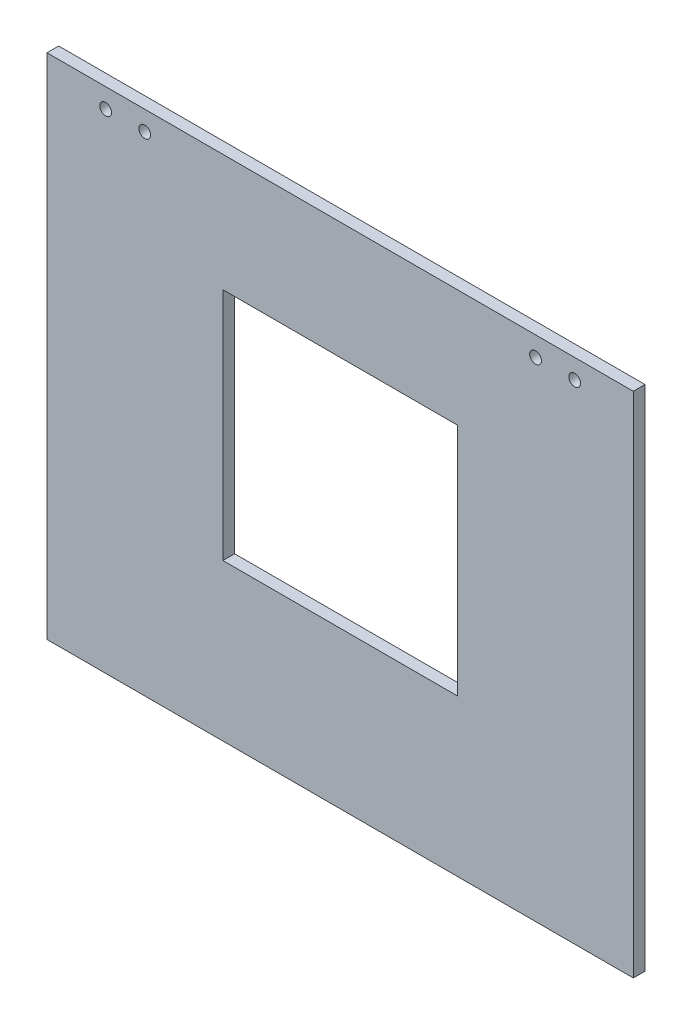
ISO-10303-21;
HEADER;
FILE_DESCRIPTION(('STEP AP214'),'2;1');
FILE_NAME('part.step','',(''),(''),'','','');
FILE_SCHEMA(('AUTOMOTIVE_DESIGN { 1 0 10303 214 1 1 1 1 }'));
ENDSEC;
DATA;
#1=APPLICATION_CONTEXT('core data for automotive mechanical design processes');
#2=APPLICATION_PROTOCOL_DEFINITION('international standard','automotive_design',2000,#1);
#3=PRODUCT_CONTEXT('',#1,'mechanical');
#4=PRODUCT('Part','Part','',(#3));
#5=PRODUCT_RELATED_PRODUCT_CATEGORY('part','',(#4));
#6=PRODUCT_DEFINITION_FORMATION('','',#4);
#7=PRODUCT_DEFINITION_CONTEXT('part definition',#1,'design');
#8=PRODUCT_DEFINITION('design','',#6,#7);
#9=PRODUCT_DEFINITION_SHAPE('','',#8);
#10=(LENGTH_UNIT() NAMED_UNIT(*) SI_UNIT(.MILLI.,.METRE.));
#11=(NAMED_UNIT(*) PLANE_ANGLE_UNIT() SI_UNIT($,.RADIAN.));
#12=(NAMED_UNIT(*) SI_UNIT($,.STERADIAN.) SOLID_ANGLE_UNIT());
#13=UNCERTAINTY_MEASURE_WITH_UNIT(LENGTH_MEASURE(1.E-05),#10,'distance_accuracy_value','');
#14=(GEOMETRIC_REPRESENTATION_CONTEXT(3) GLOBAL_UNCERTAINTY_ASSIGNED_CONTEXT((#13)) GLOBAL_UNIT_ASSIGNED_CONTEXT((#10,
#11,#12)) REPRESENTATION_CONTEXT('',''));
#15=CARTESIAN_POINT('',(0.,0.,0.));
#16=DIRECTION('',(0.,0.,1.));
#17=DIRECTION('',(1.,0.,0.));
#18=AXIS2_PLACEMENT_3D('',#15,#16,#17);
#19=CARTESIAN_POINT('',(0.,130.,3.));
#20=DIRECTION('',(0.,0.,-1.));
#21=DIRECTION('',(-1.,0.,0.));
#22=AXIS2_PLACEMENT_3D('',#19,#20,#21);
#23=PLANE('',#22);
#24=CARTESIAN_POINT('',(25.,125.,3.));
#25=DIRECTION('',(0.,0.,1.));
#26=DIRECTION('',(1.,0.,0.));
#27=AXIS2_PLACEMENT_3D('',#24,#25,#26);
#28=CIRCLE('',#27,1.5);
#29=CARTESIAN_POINT('',(26.5,125.,3.));
#30=VERTEX_POINT('',#29);
#31=EDGE_CURVE('E241',#30,#30,#28,.T.);
#32=ORIENTED_EDGE('',*,*,#31,.F.);
#33=EDGE_LOOP('',(#32));
#34=FACE_BOUND('',#33,.T.);
#35=CARTESIAN_POINT('',(15.,125.,3.));
#36=DIRECTION('',(0.,0.,1.));
#37=DIRECTION('',(1.,0.,0.));
#38=AXIS2_PLACEMENT_3D('',#35,#36,#37);
#39=CIRCLE('',#38,1.5);
#40=CARTESIAN_POINT('',(16.5,125.,3.));
#41=VERTEX_POINT('',#40);
#42=EDGE_CURVE('E113',#41,#41,#39,.T.);
#43=ORIENTED_EDGE('',*,*,#42,.F.);
#44=EDGE_LOOP('',(#43));
#45=FACE_BOUND('',#44,.T.);
#46=DIRECTION('',(0.,-1.,0.));
#47=VECTOR('',#46,1.);
#48=CARTESIAN_POINT('',(0.,0.,3.));
#49=LINE('',#48,#47);
#50=CARTESIAN_POINT('',(0.,130.,3.));
#51=VERTEX_POINT('',#50);
#52=CARTESIAN_POINT('',(0.,0.,3.));
#53=VERTEX_POINT('',#52);
#54=EDGE_CURVE('E141',#51,#53,#49,.T.);
#55=ORIENTED_EDGE('',*,*,#54,.T.);
#56=DIRECTION('',(1.,0.,0.));
#57=VECTOR('',#56,1.);
#58=CARTESIAN_POINT('',(0.,0.,3.));
#59=LINE('',#58,#57);
#60=CARTESIAN_POINT('',(150.,0.,3.));
#61=VERTEX_POINT('',#60);
#62=EDGE_CURVE('E144',#53,#61,#59,.T.);
#63=ORIENTED_EDGE('',*,*,#62,.T.);
#64=DIRECTION('',(0.,1.,0.));
#65=VECTOR('',#64,1.);
#66=CARTESIAN_POINT('',(150.,0.,3.));
#67=LINE('',#66,#65);
#68=CARTESIAN_POINT('',(150.,130.,3.));
#69=VERTEX_POINT('',#68);
#70=EDGE_CURVE('E146',#61,#69,#67,.T.);
#71=ORIENTED_EDGE('',*,*,#70,.T.);
#72=DIRECTION('',(-1.,0.,0.));
#73=VECTOR('',#72,1.);
#74=CARTESIAN_POINT('',(0.,130.,3.));
#75=LINE('',#74,#73);
#76=EDGE_CURVE('E148',#69,#51,#75,.T.);
#77=ORIENTED_EDGE('',*,*,#76,.T.);
#78=EDGE_LOOP('',(#55,#63,#71,#77));
#79=FACE_BOUND('',#78,.T.);
#80=DIRECTION('',(0.,-1.,0.));
#81=VECTOR('',#80,1.);
#82=CARTESIAN_POINT('',(45.,100.,3.));
#83=LINE('',#82,#81);
#84=CARTESIAN_POINT('',(45.,100.,3.));
#85=VERTEX_POINT('',#84);
#86=CARTESIAN_POINT('',(45.,39.9999999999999,3.));
#87=VERTEX_POINT('',#86);
#88=EDGE_CURVE('E106',#85,#87,#83,.T.);
#89=ORIENTED_EDGE('',*,*,#88,.F.);
#90=DIRECTION('',(-1.,0.,0.));
#91=VECTOR('',#90,1.);
#92=CARTESIAN_POINT('',(45.,100.,3.));
#93=LINE('',#92,#91);
#94=CARTESIAN_POINT('',(105.,100.,3.));
#95=VERTEX_POINT('',#94);
#96=EDGE_CURVE('E127',#95,#85,#93,.T.);
#97=ORIENTED_EDGE('',*,*,#96,.F.);
#98=DIRECTION('',(0.,1.,0.));
#99=VECTOR('',#98,1.);
#100=CARTESIAN_POINT('',(105.,100.,3.));
#101=LINE('',#100,#99);
#102=CARTESIAN_POINT('',(105.,39.9999999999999,3.));
#103=VERTEX_POINT('',#102);
#104=EDGE_CURVE('E125',#103,#95,#101,.T.);
#105=ORIENTED_EDGE('',*,*,#104,.F.);
#106=DIRECTION('',(1.,0.,0.));
#107=VECTOR('',#106,1.);
#108=CARTESIAN_POINT('',(45.,39.9999999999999,3.));
#109=LINE('',#108,#107);
#110=EDGE_CURVE('E123',#87,#103,#109,.T.);
#111=ORIENTED_EDGE('',*,*,#110,.F.);
#112=EDGE_LOOP('',(#89,#97,#105,#111));
#113=FACE_BOUND('',#112,.T.);
#114=CARTESIAN_POINT('',(135.,125.,3.));
#115=DIRECTION('',(0.,0.,1.));
#116=DIRECTION('',(-1.,0.,0.));
#117=AXIS2_PLACEMENT_3D('',#114,#115,#116);
#118=CIRCLE('',#117,1.50000000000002);
#119=CARTESIAN_POINT('',(133.5,125.,3.));
#120=VERTEX_POINT('',#119);
#121=EDGE_CURVE('E247',#120,#120,#118,.T.);
#122=ORIENTED_EDGE('',*,*,#121,.F.);
#123=EDGE_LOOP('',(#122));
#124=FACE_BOUND('',#123,.T.);
#125=CARTESIAN_POINT('',(125.,125.,3.));
#126=DIRECTION('',(0.,0.,1.));
#127=DIRECTION('',(-1.,0.,0.));
#128=AXIS2_PLACEMENT_3D('',#125,#126,#127);
#129=CIRCLE('',#128,1.5);
#130=CARTESIAN_POINT('',(123.5,125.,3.));
#131=VERTEX_POINT('',#130);
#132=EDGE_CURVE('E230',#131,#131,#129,.T.);
#133=ORIENTED_EDGE('',*,*,#132,.F.);
#134=EDGE_LOOP('',(#133));
#135=FACE_BOUND('',#134,.T.);
#136=ADVANCED_FACE('F26',(#34,#45,#79,#113,#124,#135),#23,.F.);
#137=CARTESIAN_POINT('',(0.,130.,0.));
#138=DIRECTION('',(0.,0.,-1.));
#139=DIRECTION('',(-1.,0.,0.));
#140=AXIS2_PLACEMENT_3D('',#137,#138,#139);
#141=PLANE('',#140);
#142=CARTESIAN_POINT('',(25.,125.,0.));
#143=DIRECTION('',(0.,0.,1.));
#144=DIRECTION('',(1.,0.,0.));
#145=AXIS2_PLACEMENT_3D('',#142,#143,#144);
#146=CIRCLE('',#145,1.5);
#147=CARTESIAN_POINT('',(26.5,125.,0.));
#148=VERTEX_POINT('',#147);
#149=EDGE_CURVE('E236',#148,#148,#146,.T.);
#150=ORIENTED_EDGE('',*,*,#149,.T.);
#151=EDGE_LOOP('',(#150));
#152=FACE_BOUND('',#151,.T.);
#153=CARTESIAN_POINT('',(15.,125.,0.));
#154=DIRECTION('',(0.,0.,1.));
#155=DIRECTION('',(1.,0.,0.));
#156=AXIS2_PLACEMENT_3D('',#153,#154,#155);
#157=CIRCLE('',#156,1.5);
#158=CARTESIAN_POINT('',(16.5,125.,0.));
#159=VERTEX_POINT('',#158);
#160=EDGE_CURVE('E116',#159,#159,#157,.T.);
#161=ORIENTED_EDGE('',*,*,#160,.T.);
#162=EDGE_LOOP('',(#161));
#163=FACE_BOUND('',#162,.T.);
#164=DIRECTION('',(0.,-1.,0.));
#165=VECTOR('',#164,1.);
#166=CARTESIAN_POINT('',(0.,0.,0.));
#167=LINE('',#166,#165);
#168=CARTESIAN_POINT('',(0.,130.,0.));
#169=VERTEX_POINT('',#168);
#170=CARTESIAN_POINT('',(0.,0.,0.));
#171=VERTEX_POINT('',#170);
#172=EDGE_CURVE('E107',#169,#171,#167,.T.);
#173=ORIENTED_EDGE('',*,*,#172,.F.);
#174=DIRECTION('',(-1.,0.,0.));
#175=VECTOR('',#174,1.);
#176=CARTESIAN_POINT('',(0.,130.,0.));
#177=LINE('',#176,#175);
#178=CARTESIAN_POINT('',(150.,130.,0.));
#179=VERTEX_POINT('',#178);
#180=EDGE_CURVE('E139',#179,#169,#177,.T.);
#181=ORIENTED_EDGE('',*,*,#180,.F.);
#182=DIRECTION('',(0.,1.,0.));
#183=VECTOR('',#182,1.);
#184=CARTESIAN_POINT('',(150.,0.,0.));
#185=LINE('',#184,#183);
#186=CARTESIAN_POINT('',(150.,0.,0.));
#187=VERTEX_POINT('',#186);
#188=EDGE_CURVE('E137',#187,#179,#185,.T.);
#189=ORIENTED_EDGE('',*,*,#188,.F.);
#190=DIRECTION('',(1.,0.,0.));
#191=VECTOR('',#190,1.);
#192=CARTESIAN_POINT('',(0.,0.,0.));
#193=LINE('',#192,#191);
#194=EDGE_CURVE('E135',#171,#187,#193,.T.);
#195=ORIENTED_EDGE('',*,*,#194,.F.);
#196=EDGE_LOOP('',(#173,#181,#189,#195));
#197=FACE_BOUND('',#196,.T.);
#198=DIRECTION('',(-1.,0.,0.));
#199=VECTOR('',#198,1.);
#200=CARTESIAN_POINT('',(45.,100.,0.));
#201=LINE('',#200,#199);
#202=CARTESIAN_POINT('',(105.,100.,0.));
#203=VERTEX_POINT('',#202);
#204=CARTESIAN_POINT('',(45.,100.,0.));
#205=VERTEX_POINT('',#204);
#206=EDGE_CURVE('E112',#203,#205,#201,.T.);
#207=ORIENTED_EDGE('',*,*,#206,.T.);
#208=DIRECTION('',(0.,-1.,0.));
#209=VECTOR('',#208,1.);
#210=CARTESIAN_POINT('',(45.,100.,0.));
#211=LINE('',#210,#209);
#212=CARTESIAN_POINT('',(45.,39.9999999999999,0.));
#213=VERTEX_POINT('',#212);
#214=EDGE_CURVE('E49',#205,#213,#211,.T.);
#215=ORIENTED_EDGE('',*,*,#214,.T.);
#216=DIRECTION('',(1.,0.,0.));
#217=VECTOR('',#216,1.);
#218=CARTESIAN_POINT('',(45.,39.9999999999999,0.));
#219=LINE('',#218,#217);
#220=CARTESIAN_POINT('',(105.,39.9999999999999,0.));
#221=VERTEX_POINT('',#220);
#222=EDGE_CURVE('E93',#213,#221,#219,.T.);
#223=ORIENTED_EDGE('',*,*,#222,.T.);
#224=DIRECTION('',(0.,1.,0.));
#225=VECTOR('',#224,1.);
#226=CARTESIAN_POINT('',(105.,100.,0.));
#227=LINE('',#226,#225);
#228=EDGE_CURVE('E102',#221,#203,#227,.T.);
#229=ORIENTED_EDGE('',*,*,#228,.T.);
#230=EDGE_LOOP('',(#207,#215,#223,#229));
#231=FACE_BOUND('',#230,.T.);
#232=CARTESIAN_POINT('',(135.,125.,0.));
#233=DIRECTION('',(0.,0.,1.));
#234=DIRECTION('',(-1.,0.,0.));
#235=AXIS2_PLACEMENT_3D('',#232,#233,#234);
#236=CIRCLE('',#235,1.50000000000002);
#237=CARTESIAN_POINT('',(133.5,125.,0.));
#238=VERTEX_POINT('',#237);
#239=EDGE_CURVE('E244',#238,#238,#236,.T.);
#240=ORIENTED_EDGE('',*,*,#239,.T.);
#241=EDGE_LOOP('',(#240));
#242=FACE_BOUND('',#241,.T.);
#243=CARTESIAN_POINT('',(125.,125.,0.));
#244=DIRECTION('',(0.,0.,1.));
#245=DIRECTION('',(-1.,0.,0.));
#246=AXIS2_PLACEMENT_3D('',#243,#244,#245);
#247=CIRCLE('',#246,1.5);
#248=CARTESIAN_POINT('',(123.5,125.,0.));
#249=VERTEX_POINT('',#248);
#250=EDGE_CURVE('E233',#249,#249,#247,.T.);
#251=ORIENTED_EDGE('',*,*,#250,.T.);
#252=EDGE_LOOP('',(#251));
#253=FACE_BOUND('',#252,.T.);
#254=ADVANCED_FACE('F110',(#152,#163,#197,#231,#242,#253),#141,.T.);
#255=CARTESIAN_POINT('',(0.,0.,3.));
#256=DIRECTION('',(1.,0.,0.));
#257=DIRECTION('',(0.,0.,-1.));
#258=AXIS2_PLACEMENT_3D('',#255,#256,#257);
#259=PLANE('',#258);
#260=ORIENTED_EDGE('',*,*,#172,.T.);
#261=DIRECTION('',(0.,0.,-1.));
#262=VECTOR('',#261,1.);
#263=CARTESIAN_POINT('',(0.,0.,3.));
#264=LINE('',#263,#262);
#265=EDGE_CURVE('E11',#53,#171,#264,.T.);
#266=ORIENTED_EDGE('',*,*,#265,.F.);
#267=ORIENTED_EDGE('',*,*,#54,.F.);
#268=DIRECTION('',(0.,0.,-1.));
#269=VECTOR('',#268,1.);
#270=CARTESIAN_POINT('',(0.,130.,3.));
#271=LINE('',#270,#269);
#272=EDGE_CURVE('E150',#51,#169,#271,.T.);
#273=ORIENTED_EDGE('',*,*,#272,.T.);
#274=EDGE_LOOP('',(#260,#266,#267,#273));
#275=FACE_BOUND('',#274,.T.);
#276=ADVANCED_FACE('F28',(#275),#259,.F.);
#277=CARTESIAN_POINT('',(0.,0.,3.));
#278=DIRECTION('',(0.,1.,0.));
#279=DIRECTION('',(0.,0.,1.));
#280=AXIS2_PLACEMENT_3D('',#277,#278,#279);
#281=PLANE('',#280);
#282=ORIENTED_EDGE('',*,*,#194,.T.);
#283=DIRECTION('',(0.,0.,-1.));
#284=VECTOR('',#283,1.);
#285=CARTESIAN_POINT('',(150.,0.,3.));
#286=LINE('',#285,#284);
#287=EDGE_CURVE('E34',#61,#187,#286,.T.);
#288=ORIENTED_EDGE('',*,*,#287,.F.);
#289=ORIENTED_EDGE('',*,*,#62,.F.);
#290=ORIENTED_EDGE('',*,*,#265,.T.);
#291=EDGE_LOOP('',(#282,#288,#289,#290));
#292=FACE_BOUND('',#291,.T.);
#293=ADVANCED_FACE('F175',(#292),#281,.F.);
#294=CARTESIAN_POINT('',(150.,0.,3.));
#295=DIRECTION('',(-1.,0.,0.));
#296=DIRECTION('',(0.,0.,1.));
#297=AXIS2_PLACEMENT_3D('',#294,#295,#296);
#298=PLANE('',#297);
#299=ORIENTED_EDGE('',*,*,#188,.T.);
#300=DIRECTION('',(0.,0.,-1.));
#301=VECTOR('',#300,1.);
#302=CARTESIAN_POINT('',(150.,130.,3.));
#303=LINE('',#302,#301);
#304=EDGE_CURVE('E153',#69,#179,#303,.T.);
#305=ORIENTED_EDGE('',*,*,#304,.F.);
#306=ORIENTED_EDGE('',*,*,#70,.F.);
#307=ORIENTED_EDGE('',*,*,#287,.T.);
#308=EDGE_LOOP('',(#299,#305,#306,#307));
#309=FACE_BOUND('',#308,.T.);
#310=ADVANCED_FACE('F160',(#309),#298,.F.);
#311=CARTESIAN_POINT('',(0.,130.,3.));
#312=DIRECTION('',(0.,-1.,0.));
#313=DIRECTION('',(0.,0.,-1.));
#314=AXIS2_PLACEMENT_3D('',#311,#312,#313);
#315=PLANE('',#314);
#316=ORIENTED_EDGE('',*,*,#180,.T.);
#317=ORIENTED_EDGE('',*,*,#272,.F.);
#318=ORIENTED_EDGE('',*,*,#76,.F.);
#319=ORIENTED_EDGE('',*,*,#304,.T.);
#320=EDGE_LOOP('',(#316,#317,#318,#319));
#321=FACE_BOUND('',#320,.T.);
#322=ADVANCED_FACE('F168',(#321),#315,.F.);
#323=CARTESIAN_POINT('',(45.,100.,3.));
#324=DIRECTION('',(1.,0.,0.));
#325=DIRECTION('',(0.,1.,0.));
#326=AXIS2_PLACEMENT_3D('',#323,#324,#325);
#327=PLANE('',#326);
#328=ORIENTED_EDGE('',*,*,#214,.F.);
#329=DIRECTION('',(0.,0.,-1.));
#330=VECTOR('',#329,1.);
#331=CARTESIAN_POINT('',(45.,100.,3.));
#332=LINE('',#331,#330);
#333=EDGE_CURVE('E129',#85,#205,#332,.T.);
#334=ORIENTED_EDGE('',*,*,#333,.F.);
#335=ORIENTED_EDGE('',*,*,#88,.T.);
#336=DIRECTION('',(0.,0.,-1.));
#337=VECTOR('',#336,1.);
#338=CARTESIAN_POINT('',(45.,39.9999999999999,3.));
#339=LINE('',#338,#337);
#340=EDGE_CURVE('E95',#87,#213,#339,.T.);
#341=ORIENTED_EDGE('',*,*,#340,.T.);
#342=EDGE_LOOP('',(#328,#334,#335,#341));
#343=FACE_BOUND('',#342,.T.);
#344=ADVANCED_FACE('F104',(#343),#327,.T.);
#345=CARTESIAN_POINT('',(45.,39.9999999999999,3.));
#346=DIRECTION('',(0.,1.,0.));
#347=DIRECTION('',(0.,0.,1.));
#348=AXIS2_PLACEMENT_3D('',#345,#346,#347);
#349=PLANE('',#348);
#350=ORIENTED_EDGE('',*,*,#222,.F.);
#351=ORIENTED_EDGE('',*,*,#340,.F.);
#352=ORIENTED_EDGE('',*,*,#110,.T.);
#353=DIRECTION('',(0.,0.,-1.));
#354=VECTOR('',#353,1.);
#355=CARTESIAN_POINT('',(105.,39.9999999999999,3.));
#356=LINE('',#355,#354);
#357=EDGE_CURVE('E98',#103,#221,#356,.T.);
#358=ORIENTED_EDGE('',*,*,#357,.T.);
#359=EDGE_LOOP('',(#350,#351,#352,#358));
#360=FACE_BOUND('',#359,.T.);
#361=ADVANCED_FACE('F94',(#360),#349,.T.);
#362=CARTESIAN_POINT('',(105.,100.,3.));
#363=DIRECTION('',(-1.,0.,0.));
#364=DIRECTION('',(0.,0.,1.));
#365=AXIS2_PLACEMENT_3D('',#362,#363,#364);
#366=PLANE('',#365);
#367=ORIENTED_EDGE('',*,*,#228,.F.);
#368=ORIENTED_EDGE('',*,*,#357,.F.);
#369=ORIENTED_EDGE('',*,*,#104,.T.);
#370=DIRECTION('',(0.,0.,-1.));
#371=VECTOR('',#370,1.);
#372=CARTESIAN_POINT('',(105.,100.,3.));
#373=LINE('',#372,#371);
#374=EDGE_CURVE('E41',#95,#203,#373,.T.);
#375=ORIENTED_EDGE('',*,*,#374,.T.);
#376=EDGE_LOOP('',(#367,#368,#369,#375));
#377=FACE_BOUND('',#376,.T.);
#378=ADVANCED_FACE('F201',(#377),#366,.T.);
#379=CARTESIAN_POINT('',(45.,100.,3.));
#380=DIRECTION('',(0.,-1.,0.));
#381=DIRECTION('',(0.,0.,-1.));
#382=AXIS2_PLACEMENT_3D('',#379,#380,#381);
#383=PLANE('',#382);
#384=ORIENTED_EDGE('',*,*,#206,.F.);
#385=ORIENTED_EDGE('',*,*,#374,.F.);
#386=ORIENTED_EDGE('',*,*,#96,.T.);
#387=ORIENTED_EDGE('',*,*,#333,.T.);
#388=EDGE_LOOP('',(#384,#385,#386,#387));
#389=FACE_BOUND('',#388,.T.);
#390=ADVANCED_FACE('F206',(#389),#383,.T.);
#391=CARTESIAN_POINT('',(15.,125.,3.));
#392=DIRECTION('',(0.,0.,-1.));
#393=DIRECTION('',(-1.,0.,0.));
#394=AXIS2_PLACEMENT_3D('',#391,#392,#393);
#395=CYLINDRICAL_SURFACE('',#394,1.5);
#396=ORIENTED_EDGE('',*,*,#42,.T.);
#397=EDGE_LOOP('',(#396));
#398=FACE_BOUND('',#397,.T.);
#399=ORIENTED_EDGE('',*,*,#160,.F.);
#400=EDGE_LOOP('',(#399));
#401=FACE_BOUND('',#400,.T.);
#402=ADVANCED_FACE('F210',(#398,#401),#395,.F.);
#403=CARTESIAN_POINT('',(135.,125.,3.));
#404=DIRECTION('',(0.,0.,-1.));
#405=DIRECTION('',(-1.,0.,0.));
#406=AXIS2_PLACEMENT_3D('',#403,#404,#405);
#407=CYLINDRICAL_SURFACE('',#406,1.50000000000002);
#408=ORIENTED_EDGE('',*,*,#121,.T.);
#409=EDGE_LOOP('',(#408));
#410=FACE_BOUND('',#409,.T.);
#411=ORIENTED_EDGE('',*,*,#239,.F.);
#412=EDGE_LOOP('',(#411));
#413=FACE_BOUND('',#412,.T.);
#414=ADVANCED_FACE('F213',(#410,#413),#407,.F.);
#415=CARTESIAN_POINT('',(25.,125.,3.));
#416=DIRECTION('',(0.,0.,-1.));
#417=DIRECTION('',(-1.,0.,0.));
#418=AXIS2_PLACEMENT_3D('',#415,#416,#417);
#419=CYLINDRICAL_SURFACE('',#418,1.5);
#420=ORIENTED_EDGE('',*,*,#31,.T.);
#421=EDGE_LOOP('',(#420));
#422=FACE_BOUND('',#421,.T.);
#423=ORIENTED_EDGE('',*,*,#149,.F.);
#424=EDGE_LOOP('',(#423));
#425=FACE_BOUND('',#424,.T.);
#426=ADVANCED_FACE('F217',(#422,#425),#419,.F.);
#427=CARTESIAN_POINT('',(125.,125.,3.));
#428=DIRECTION('',(0.,0.,-1.));
#429=DIRECTION('',(-1.,0.,0.));
#430=AXIS2_PLACEMENT_3D('',#427,#428,#429);
#431=CYLINDRICAL_SURFACE('',#430,1.5);
#432=ORIENTED_EDGE('',*,*,#132,.T.);
#433=EDGE_LOOP('',(#432));
#434=FACE_BOUND('',#433,.T.);
#435=ORIENTED_EDGE('',*,*,#250,.F.);
#436=EDGE_LOOP('',(#435));
#437=FACE_BOUND('',#436,.T.);
#438=ADVANCED_FACE('F221',(#434,#437),#431,.F.);
#439=CLOSED_SHELL('',(#136,#254,#276,#293,#310,#322,#344,#361,#378,#390,#402,#414,#426,#438));
#440=MANIFOLD_SOLID_BREP('B2',#439);
#441=ADVANCED_BREP_SHAPE_REPRESENTATION('',(#18,#440),#14);
#442=SHAPE_DEFINITION_REPRESENTATION(#9,#441);
ENDSEC;
END-ISO-10303-21;
